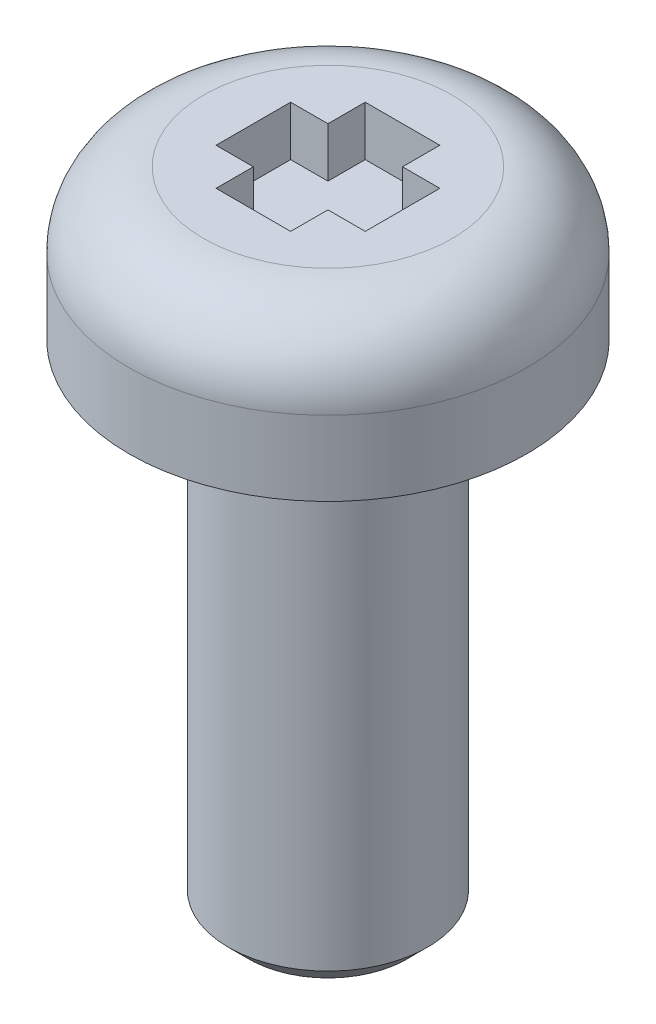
from build123d import *

# Parameters (mm, degrees)
SKETCH2_W               = 1.5
SKETCH2_H               = 3
CUT_EXTRUDE_THIN2_DEPTH = 1
CIRPATTERN1_COUNT       = 2
CIRPATTERN1_ANGLE       = 90
SKETCH3_R               = 2
BOSS_EXTRUDE1_DEPTH     = 10
FILLET1_R               = 0.4572
CHAMFER1_SIZE           = 0.4064


with BuildPart() as part:
    # Sketch1 → Base-Revolve (revolve)
    with BuildSketch(Plane.XY, mode=Mode.PRIVATE) as base_revolve_sk:
        with BuildLine():
            Line((4, 0), (0, 0))
            Line((0, 0), (0, 3))
            Line((0, 3), (2.5, 3))
            ThreePointArc((2.5, 3), (3.560660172, 2.560660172), (4, 1.5))
            Line((4, 1.5), (4, 0))
        make_face()
    revolve(base_revolve_sk.sketch.rotate(Axis((0, 11.592517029, 0), (0, -1, 0)), 90), axis=Axis((0, 11.592517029, 0), (0, -1, 0)))

    # Sketch2 → Cut-Extrude-Thin2 (cut)
    with BuildSketch(Plane(origin=(0, 3, 0), x_dir=(-1, 0, 0), z_dir=(0, 1, 0))):
        Rectangle(SKETCH2_W, SKETCH2_H)
    cut_extrude_thin2 = extrude(amount=-CUT_EXTRUDE_THIN2_DEPTH, mode=Mode.SUBTRACT)

    # CirPattern1: Cut-Extrude-Thin2 ×2 about axis
    cirpattern1_axis = Axis((0, 0, 0), (0, 1, 0))
    for i in range(1, CIRPATTERN1_COUNT):
        add(cut_extrude_thin2.rotate(cirpattern1_axis, i * CIRPATTERN1_ANGLE / (CIRPATTERN1_COUNT - 1)), mode=Mode.SUBTRACT)

    # Sketch3 → Boss-Extrude1 (add)
    with BuildSketch(Plane.XZ):
        with Locations(Location((0, 0, 0), (0, 0, 90))):
            Circle(SKETCH3_R)
    extrude(amount=BOSS_EXTRUDE1_DEPTH)

    # Fillet1
    fillet1_edges = [part.edges().sort_by_distance(p)[0] for p in [
        (0, 0, -2),
    ]]
    fillet(fillet1_edges, radius=FILLET1_R)

    # Chamfer1
    chamfer1_edges = [part.edges().sort_by_distance(p)[0] for p in [
        (0, -10, -2),
    ]]
    chamfer(chamfer1_edges, length=CHAMFER1_SIZE)


solid = part.part
